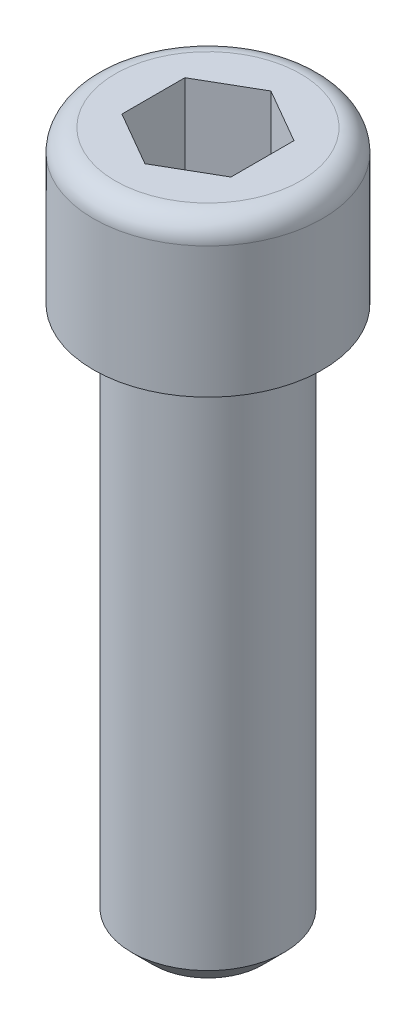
from build123d import *

# Parameters (mm, degrees)
ESQUISSE1_R             = 7
EXTRUSION1_DEPTH        = 50
ESQUISSE2_R             = 10.5
EXTRUSION2_DEPTH        = 14
CONG_1_R                = 2
ENL_V_MAT_EXTRU_1_DEPTH = 11
CHANFREIN1_SIZE         = 2


with BuildPart() as part:
    # Esquisse1 → Extrusion1 (new body)
    with BuildSketch(Plane(origin=(0, 0, 0), x_dir=(1, 0, 0), z_dir=(0, 1, 0))):
        with Locations(Location((0, 0, 0), (0, 0, 270))):
            Circle(ESQUISSE1_R)
    extrude(amount=-EXTRUSION1_DEPTH)

    # Esquisse2 → Extrusion2 (add)
    with BuildSketch(Plane(origin=(0, 0, 0), x_dir=(-1, 0, 0), z_dir=(0, 1, 0))):
        with Locations(Location((0, 0, 0), (0, 0, 90))):
            Circle(ESQUISSE2_R)
    extrude(amount=EXTRUSION2_DEPTH)

    # Cong_1
    cong_1_edges = [part.edges().sort_by_distance(p)[0] for p in [
        (0, 14, -10.5),
    ]]
    fillet(cong_1_edges, radius=CONG_1_R)

    # Esquisse3 → Enl_v. mat.-Extru.1 (cut)
    with BuildSketch(Plane(origin=(0, 14, 0), x_dir=(-1, 0, 0), z_dir=(0, 1, 0))):
        Polygon((0, 5.773502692), (-5, 2.886751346), (-5, -2.886751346), (0, -5.773502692), (5, -2.886751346), (5, 2.886751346), align=None)
    extrude(amount=-ENL_V_MAT_EXTRU_1_DEPTH, mode=Mode.SUBTRACT)

    # Chanfrein1
    chanfrein1_edges = [part.edges().sort_by_distance(p)[0] for p in [
        (0, -50, -7),
    ]]
    chamfer(chanfrein1_edges, length=CHANFREIN1_SIZE)


solid = part.part
